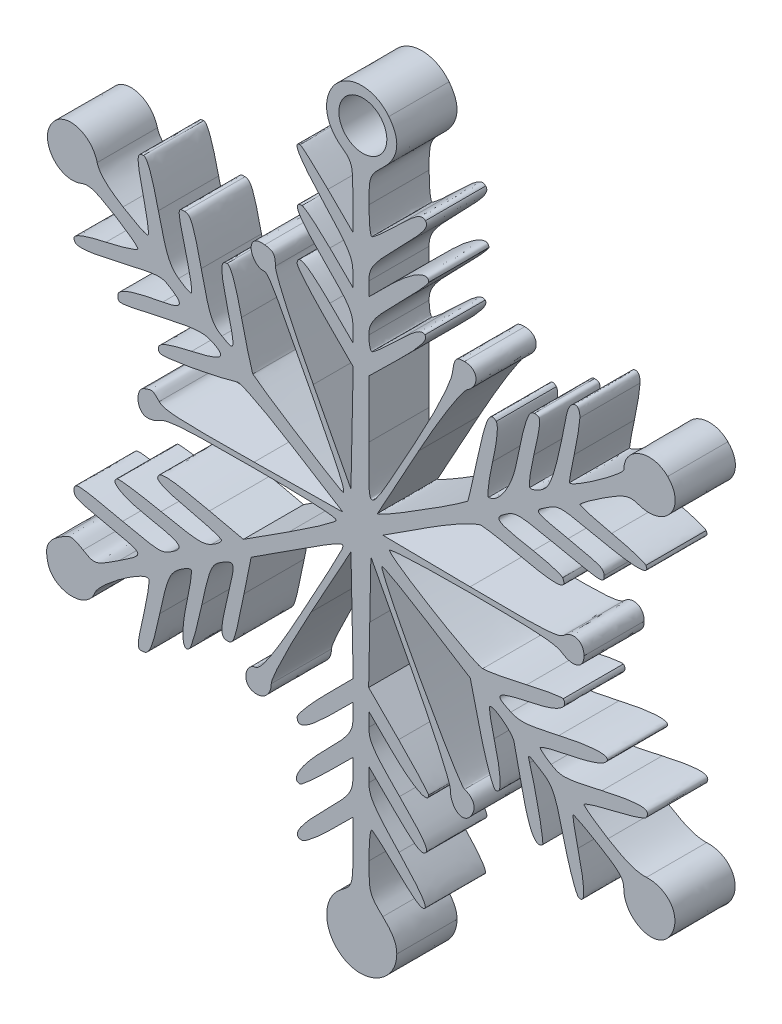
from build123d import *

# Parameters (mm, degrees)
BOSS_EXTRUDE1_DEPTH = 4
SKETCH3_R           = 1.592218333
CUT_EXTRUDE1_DEPTH  = 4


with BuildPart() as part:
    # Model → Boss-Extrude1 (new body)
    with BuildSketch(Plane.XY):
        with BuildLine():
            Line((27.5578062, 9.3178884), (27.5578062, 11.310366))
            Line((27.5578062, 11.310366), (26.028777, 9.797288))
            add(Edge.make_bspline(
                [(26.028777, 9.797288), (25.1878084, 8.9651078), (24.3543582, 8.2842354), (24.1766852, 8.2842354)],
                knots=[0, 0, 0, 0, 1, 1, 1, 1], degree=3))
            add(Edge.make_bspline(
                [(24.1766852, 8.2842354), (23.4748832, 8.2842354), (23.935055, 9.0406728), (25.7057144, 10.7977686)],
                knots=[0, 0, 0, 0, 1, 1, 1, 1], degree=3))
            add(Edge.make_bspline(
                [(25.7057144, 10.7977686), (27.3834606, 12.462637), (27.5578062, 12.7352298), (27.5578062, 13.6934448)],
                knots=[0, 0, 0, 0, 1, 1, 1, 1], degree=3))
            Line((27.5578062, 13.6934448), (27.5578062, 14.7512278))
            Line((27.5578062, 14.7512278), (25.8970272, 13.1052316))
            add(Edge.make_bspline(
                [(25.8970272, 13.1052316), (24.9836178, 12.1999248), (24.1501676, 11.4592354), (24.0449354, 11.4592354)],
                knots=[0, 0, 0, 0, 1, 1, 1, 1], degree=3))
            add(Edge.make_bspline(
                [(24.0449354, 11.4592354), (23.3943652, 11.4592354), (24.1063526, 12.6502668), (25.7057144, 14.237335)],
                knots=[0, 0, 0, 0, 1, 1, 1, 1], degree=3))
            add(Edge.make_bspline(
                [(25.7057144, 14.237335), (27.2950178, 15.8144718), (27.5578062, 16.2064446), (27.5578062, 17.000093)],
                knots=[0, 0, 0, 0, 1, 1, 1, 1], degree=3))
            Line((27.5578062, 17.000093), (27.5578062, 17.9249324))
            Line((27.5578062, 17.9249324), (26.028777, 16.4118798))
            add(Edge.make_bspline(
                [(26.028777, 16.4118798), (24.539448, 14.9380956), (23.8536226, 14.563344), (23.8536226, 15.2233122)],
                knots=[0, 0, 0, 0, 1, 1, 1, 1], degree=3))
            add(Edge.make_bspline(
                [(23.8536226, 15.2233122), (23.8536226, 15.401798), (24.690578, 16.3903914), (25.7135122, 17.420209)],
                knots=[0, 0, 0, 0, 1, 1, 1, 1], degree=3))
            Line((25.7135122, 17.420209), (27.5734018, 19.2925954))
            Line((27.5734018, 19.2925954), (27.4994116, 22.8981508))
            Line((27.4994116, 22.8981508), (27.4254976, 26.5037062))
            Line((27.4254976, 26.5037062), (24.7796812, 21.7193368))
            add(Edge.make_bspline(
                [(24.7796812, 21.7193368), (23.3244644, 19.0879476), (22.1338394, 16.6392352), (22.1338394, 16.2777932)],
                knots=[0, 0, 0, 0, 1, 1, 1, 1], degree=3))
            add(Edge.make_bspline(
                [(22.1338394, 16.2777932), (22.1338394, 15.5156916), (21.480145, 15.002256), (20.8283302, 15.2523952)],
                knots=[0, 0, 0, 0, 1, 1, 1, 1], degree=3))
            add(Edge.make_bspline(
                [(20.8283302, 15.2523952), (20.2015852, 15.4928824), (20.3905104, 16.5959536), (21.0754976, 16.6954454)],
                knots=[0, 0, 0, 0, 1, 1, 1, 1], degree=3))
            add(Edge.make_bspline(
                [(21.0754976, 16.6954454), (21.4573866, 16.7509444), (22.3042734, 18.0354732), (24.1182144, 21.3106762)],
                knots=[0, 0, 0, 0, 1, 1, 1, 1], degree=3))
            add(Edge.make_bspline(
                [(24.1182144, 21.3106762), (25.5006602, 23.8067596), (26.7207492, 26.0736334), (26.8294866, 26.348182)],
                knots=[0, 0, 0, 0, 1, 1, 1, 1], degree=3))
            add(Edge.make_bspline(
                [(26.8294866, 26.348182), (27.0545814, 26.9164054), (26.8564868, 26.8104366), (22.9202488, 24.2573048)],
                knots=[0, 0, 0, 0, 1, 1, 1, 1], degree=3))
            Line((22.9202488, 24.2573048), (20.7962246, 22.8796088))
            Line((20.7962246, 22.8796088), (20.3236068, 20.5428596))
            add(Edge.make_bspline(
                [(20.3236068, 20.5428596), (19.6918834, 17.419447), (19.6441314, 17.2800518), (19.205575, 17.2800518)],
                knots=[0, 0, 0, 0, 1, 1, 1, 1], degree=3))
            add(Edge.make_bspline(
                [(19.205575, 17.2800518), (18.7356496, 17.2800518), (18.7401708, 17.7703226), (19.228689, 19.793585)],
                knots=[0, 0, 0, 0, 1, 1, 1, 1], degree=3))
            add(Edge.make_bspline(
                [(19.228689, 19.793585), (19.7778116, 22.0677994), (19.75993, 22.1549722), (18.8542168, 21.6199466)],
                knots=[0, 0, 0, 0, 1, 1, 1, 1], degree=3))
            add(Edge.make_bspline(
                [(18.8542168, 21.6199466), (18.1696614, 21.2155786), (18.0277262, 20.8834736), (17.5197262, 18.4977786)],
                knots=[0, 0, 0, 0, 1, 1, 1, 1], degree=3))
            add(Edge.make_bspline(
                [(17.5197262, 18.4977786), (17.2070776, 17.0294554), (16.8413176, 15.7181804), (16.7069262, 15.5838144)],
                knots=[0, 0, 0, 0, 1, 1, 1, 1], degree=3))
            add(Edge.make_bspline(
                [(16.7069262, 15.5838144), (16.2053524, 15.0822152), (16.1181796, 16.3070286), (16.5238684, 18.1558692)],
                knots=[0, 0, 0, 0, 1, 1, 1, 1], degree=3))
            add(Edge.make_bspline(
                [(16.5238684, 18.1558692), (16.7523668, 19.197193), (16.8857422, 20.1027792), (16.820261, 20.1682604)],
                knots=[0, 0, 0, 0, 1, 1, 1, 1], degree=3))
            add(Edge.make_bspline(
                [(16.820261, 20.1682604), (16.7547544, 20.233767), (16.3815268, 20.0486772), (15.9908494, 19.7569836)],
                knots=[0, 0, 0, 0, 1, 1, 1, 1], degree=3))
            add(Edge.make_bspline(
                [(15.9908494, 19.7569836), (15.3958798, 19.312763), (15.1908002, 18.8002164), (14.7282662, 16.6013638)],
                knots=[0, 0, 0, 0, 1, 1, 1, 1], degree=3))
            add(Edge.make_bspline(
                [(14.7282662, 16.6013638), (14.3093948, 14.6101054), (14.066647, 13.9550394), (13.7231374, 13.8888724)],
                knots=[0, 0, 0, 0, 1, 1, 1, 1], degree=3))
            add(Edge.make_bspline(
                [(13.7231374, 13.8888724), (13.1676394, 13.781913), (13.1669282, 13.847191), (13.6986518, 16.2018218)],
                knots=[0, 0, 0, 0, 1, 1, 1, 1], degree=3))
            add(Edge.make_bspline(
                [(13.6986518, 16.2018218), (13.9342876, 17.2452284), (14.0653008, 18.1606698), (13.989812, 18.2361586)],
                knots=[0, 0, 0, 0, 1, 1, 1, 1], degree=3))
            add(Edge.make_bspline(
                [(13.989812, 18.2361586), (13.6853676, 18.540603), (10.7029504, 16.387064), (10.4309164, 15.6663644)],
                knots=[0, 0, 0, 0, 1, 1, 1, 1], degree=3))
            add(Edge.make_bspline(
                [(10.4309164, 15.6663644), (9.9079812, 14.2809722), (7.6540868, 14.3880078), (7.2958706, 15.8152592)],
                knots=[0, 0, 0, 0, 1, 1, 1, 1], degree=3))
            add(Edge.make_bspline(
                [(7.2958706, 15.8152592), (7.0738746, 16.6996872), (7.2725788, 17.151985), (8.1296256, 17.7135536)],
                knots=[0, 0, 0, 0, 1, 1, 1, 1], degree=3))
            add(Edge.make_bspline(
                [(8.1296256, 17.7135536), (8.8025732, 18.1544976), (8.8785446, 18.1548024), (9.6368362, 17.719548)],
                knots=[0, 0, 0, 0, 1, 1, 1, 1], degree=3))
            add(Edge.make_bspline(
                [(9.6368362, 17.719548), (10.4337612, 17.2621702), (10.4386634, 17.2633894), (12.0404382, 18.3160162)],
                knots=[0, 0, 0, 0, 1, 1, 1, 1], degree=3))
            add(Edge.make_bspline(
                [(12.0404382, 18.3160162), (13.7654538, 19.4496436), (13.7732516, 19.4294506), (11.4181382, 19.9283574)],
                knots=[0, 0, 0, 0, 1, 1, 1, 1], degree=3))
            add(Edge.make_bspline(
                [(11.4181382, 19.9283574), (9.1966542, 20.3989686), (9.0368882, 20.462113), (9.0368882, 20.8697068)],
                knots=[0, 0, 0, 0, 1, 1, 1, 1], degree=3))
            add(Edge.make_bspline(
                [(9.0368882, 20.8697068), (9.0368882, 21.3661498), (9.2373704, 21.354415), (12.2628914, 20.6807562)],
                knots=[0, 0, 0, 0, 1, 1, 1, 1], degree=3))
            add(Edge.make_bspline(
                [(12.2628914, 20.6807562), (14.7275296, 20.1319638), (14.8551646, 20.1278744), (15.5389326, 20.575905)],
                knots=[0, 0, 0, 0, 1, 1, 1, 1], degree=3))
            add(Edge.make_bspline(
                [(15.5389326, 20.575905), (16.4282628, 21.1586318), (16.1567622, 21.3580726), (13.8927078, 21.7852752)],
                knots=[0, 0, 0, 0, 1, 1, 1, 1], degree=3))
            add(Edge.make_bspline(
                [(13.8927078, 21.7852752), (12.309094, 22.0840808), (11.3806986, 22.6183698), (11.8939056, 22.9355396)],
                knots=[0, 0, 0, 0, 1, 1, 1, 1], degree=3))
            add(Edge.make_bspline(
                [(11.8939056, 22.9355396), (12.0241568, 23.0160576), (13.3388354, 22.8275134), (14.8153374, 22.5165412)],
                knots=[0, 0, 0, 0, 1, 1, 1, 1], degree=3))
            add(Edge.make_bspline(
                [(14.8153374, 22.5165412), (17.1259754, 22.0299026), (17.5923448, 22.0006164), (18.1632098, 22.3061276)],
                knots=[0, 0, 0, 0, 1, 1, 1, 1], degree=3))
            add(Edge.make_bspline(
                [(18.1632098, 22.3061276), (18.5280046, 22.5013774), (18.82648, 22.7542344), (18.82648, 22.8680518)],
                knots=[0, 0, 0, 0, 1, 1, 1, 1], degree=3))
            add(Edge.make_bspline(
                [(18.82648, 22.8680518), (18.82648, 22.9818946), (17.87398, 23.2797096), (16.7098218, 23.5298742)],
                knots=[0, 0, 0, 0, 1, 1, 1, 1], degree=3))
            add(Edge.make_bspline(
                [(16.7098218, 23.5298742), (15.3532586, 23.8213646), (14.5931382, 24.1110516), (14.5931382, 24.3365274)],
                knots=[0, 0, 0, 0, 1, 1, 1, 1], degree=3))
            add(Edge.make_bspline(
                [(14.5931382, 24.3365274), (14.5931382, 24.8096024), (15.3597102, 24.771096), (18.03273, 24.163782)],
                knots=[0, 0, 0, 0, 1, 1, 1, 1], degree=3))
            Line((18.03273, 24.163782), (20.2816968, 23.6528102))
            Line((20.2816968, 23.6528102), (23.3169206, 25.6033524))
            add(Edge.make_bspline(
                [(23.3169206, 25.6033524), (24.9863102, 26.6761468), (26.3933178, 27.6774148), (26.4436352, 27.8283924)],
                knots=[0, 0, 0, 0, 1, 1, 1, 1], degree=3))
            add(Edge.make_bspline(
                [(26.4436352, 27.8283924), (26.5049508, 28.012136), (24.6848884, 28.103703), (20.9364834, 28.1054302)],
                knots=[0, 0, 0, 0, 1, 1, 1, 1], degree=3))
            add(Edge.make_bspline(
                [(20.9364834, 28.1054302), (16.4274246, 28.1074368), (15.2211532, 28.0315162), (14.7381976, 27.715083)],
                knots=[0, 0, 0, 0, 1, 1, 1, 1], degree=3))
            add(Edge.make_bspline(
                [(14.7381976, 27.715083), (14.4083786, 27.4989798), (13.9431776, 27.3971512), (13.7043922, 27.488769)],
                knots=[0, 0, 0, 0, 1, 1, 1, 1], degree=3))
            add(Edge.make_bspline(
                [(13.7043922, 27.488769), (13.1496562, 27.7016464), (13.1383278, 28.8144458), (13.6887966, 29.0256722)],
                knots=[0, 0, 0, 0, 1, 1, 1, 1], degree=3))
            add(Edge.make_bspline(
                [(13.6887966, 29.0256722), (14.2478506, 29.2402006), (14.233398, 29.2436804), (14.6927824, 28.784296)],
                knots=[0, 0, 0, 0, 1, 1, 1, 1], degree=3))
            add(Edge.make_bspline(
                [(14.6927824, 28.784296), (15.0328122, 28.4442662), (16.003905, 28.3932884), (20.9953352, 28.4535626)],
                knots=[0, 0, 0, 0, 1, 1, 1, 1], degree=3))
            Line((20.9953352, 28.4535626), (26.8959076, 28.5247588))
            Line((26.8959076, 28.5247588), (23.605871, 30.577536))
            add(Edge.make_bspline(
                [(23.605871, 30.577536), (21.7963496, 31.706566), (20.1295762, 32.5740014), (19.901916, 32.5051928)],
                knots=[0, 0, 0, 0, 1, 1, 1, 1], degree=3))
            add(Edge.make_bspline(
                [(19.901916, 32.5051928), (18.2168546, 31.9959228), (14.8274532, 31.4024772), (14.707997, 31.5957966)],
                knots=[0, 0, 0, 0, 1, 1, 1, 1], degree=3))
            add(Edge.make_bspline(
                [(14.707997, 31.5957966), (14.4198086, 32.0620898), (14.8865844, 32.314515), (16.841216, 32.7493884)],
                knots=[0, 0, 0, 0, 1, 1, 1, 1], degree=3))
            add(Edge.make_bspline(
                [(16.841216, 32.7493884), (18.9400942, 33.216342), (19.2454022, 33.504632), (18.1631844, 33.9977222)],
                knots=[0, 0, 0, 0, 1, 1, 1, 1], degree=3))
            add(Edge.make_bspline(
                [(18.1631844, 33.9977222), (17.6331372, 34.2392254), (16.9819574, 34.1846154), (14.9220682, 33.7259676)],
                knots=[0, 0, 0, 0, 1, 1, 1, 1], degree=3))
            add(Edge.make_bspline(
                [(14.9220682, 33.7259676), (11.8690644, 33.0461874), (11.9473472, 33.0510134), (11.9473472, 33.5416652)],
                knots=[0, 0, 0, 0, 1, 1, 1, 1], degree=3))
            add(Edge.make_bspline(
                [(11.9473472, 33.5416652), (11.9473472, 33.9215476), (12.8616456, 34.2537034), (14.9268434, 34.6240354)],
                knots=[0, 0, 0, 0, 1, 1, 1, 1], degree=3))
            add(Edge.make_bspline(
                [(14.9268434, 34.6240354), (16.2021774, 34.8527116), (16.3414456, 35.1054416), (15.4970734, 35.6587044)],
                knots=[0, 0, 0, 0, 1, 1, 1, 1], degree=3))
            add(Edge.make_bspline(
                [(15.4970734, 35.6587044), (14.8563076, 36.078541), (14.6837146, 36.0727244), (12.4366528, 35.5553518)],
                knots=[0, 0, 0, 0, 1, 1, 1, 1], degree=3))
            add(Edge.make_bspline(
                [(12.4366528, 35.5553518), (9.6458024, 34.9127826), (9.036939, 34.8787974), (9.036939, 35.3656646)],
                knots=[0, 0, 0, 0, 1, 1, 1, 1], degree=3))
            add(Edge.make_bspline(
                [(9.036939, 35.3656646), (9.036939, 35.5994208), (9.7738692, 35.8834944), (11.1535972, 36.1815888)],
                knots=[0, 0, 0, 0, 1, 1, 1, 1], degree=3))
            add(Edge.make_bspline(
                [(11.1535972, 36.1815888), (12.3177554, 36.433125), (13.2702554, 36.7393728), (13.2702554, 36.8621564)],
                knots=[0, 0, 0, 0, 1, 1, 1, 1], degree=3))
            add(Edge.make_bspline(
                [(13.2702554, 36.8621564), (13.2702554, 36.9849654), (12.5676152, 37.512244), (11.7087904, 38.03396)],
                knots=[0, 0, 0, 0, 1, 1, 1, 1], degree=3))
            add(Edge.make_bspline(
                [(11.7087904, 38.03396), (10.4299004, 38.8108444), (10.0301552, 38.937946), (9.4999048, 38.7363462)],
                knots=[0, 0, 0, 0, 1, 1, 1, 1], degree=3))
            add(Edge.make_bspline(
                [(9.4999048, 38.7363462), (8.025892, 38.175946), (6.6758566, 39.8793462), (7.5439778, 41.204261)],
                knots=[0, 0, 0, 0, 1, 1, 1, 1], degree=3))
            add(Edge.make_bspline(
                [(7.5439778, 41.204261), (8.3464908, 42.4290744), (10.1660706, 41.9881812), (10.5719372, 40.4706074)],
                knots=[0, 0, 0, 0, 1, 1, 1, 1], degree=3))
            add(Edge.make_bspline(
                [(10.5719372, 40.4706074), (10.713339, 39.9419064), (11.2258094, 39.4362178), (12.2893328, 38.7760464)],
                knots=[0, 0, 0, 0, 1, 1, 1, 1], degree=3))
            add(Edge.make_bspline(
                [(12.2893328, 38.7760464), (13.123037, 38.258496), (13.869289, 37.8991114), (13.9475972, 37.977445)],
                knots=[0, 0, 0, 0, 1, 1, 1, 1], degree=3))
            add(Edge.make_bspline(
                [(13.9475972, 37.977445), (14.0259054, 38.0557278), (13.9055856, 38.9151368), (13.6801352, 39.8871694)],
                knots=[0, 0, 0, 0, 1, 1, 1, 1], degree=3))
            add(Edge.make_bspline(
                [(13.6801352, 39.8871694), (13.1751324, 42.0647622), (13.170027, 42.4153838), (13.6434322, 42.4153838)],
                knots=[0, 0, 0, 0, 1, 1, 1, 1], degree=3))
            add(Edge.make_bspline(
                [(13.6434322, 42.4153838), (13.8993372, 42.4153838), (14.211046, 41.5722308), (14.6356324, 39.7314674)],
                knots=[0, 0, 0, 0, 1, 1, 1, 1], degree=3))
            add(Edge.make_bspline(
                [(14.6356324, 39.7314674), (15.150846, 37.4977406), (15.376017, 36.9570254), (15.9779462, 36.5080296)],
                knots=[0, 0, 0, 0, 1, 1, 1, 1], degree=3))
            add(Edge.make_bspline(
                [(15.9779462, 36.5080296), (16.375761, 36.2113068), (16.7578532, 36.0251756), (16.8270682, 36.0943652)],
                knots=[0, 0, 0, 0, 1, 1, 1, 1], degree=3))
            add(Edge.make_bspline(
                [(16.8270682, 36.0943652), (16.8962578, 36.1635802), (16.7913558, 36.8699796), (16.5940232, 37.6641614)],
                knots=[0, 0, 0, 0, 1, 1, 1, 1], degree=3))
            add(Edge.make_bspline(
                [(16.5940232, 37.6641614), (15.8631382, 40.6047448), (15.8660592, 40.5633174), (16.3903152, 40.5633174)],
                knots=[0, 0, 0, 0, 1, 1, 1, 1], degree=3))
            add(Edge.make_bspline(
                [(16.3903152, 40.5633174), (16.7892476, 40.5633174), (16.9816526, 40.0808952), (17.4822866, 37.8253244)],
                knots=[0, 0, 0, 0, 1, 1, 1, 1], degree=3))
            add(Edge.make_bspline(
                [(17.4822866, 37.8253244), (18.0238908, 35.3852988), (18.1732936, 35.038157), (18.8551566, 34.6353638)],
                knots=[0, 0, 0, 0, 1, 1, 1, 1], degree=3))
            add(Edge.make_bspline(
                [(18.8551566, 34.6353638), (19.7555612, 34.1034878), (19.7700646, 34.176462), (19.218148, 36.4622588)],
                knots=[0, 0, 0, 0, 1, 1, 1, 1], degree=3))
            add(Edge.make_bspline(
                [(19.218148, 36.4622588), (18.7362084, 38.4582162), (18.731357, 38.9758174), (19.1945514, 38.9758174)],
                knots=[0, 0, 0, 0, 1, 1, 1, 1], degree=3))
            add(Edge.make_bspline(
                [(19.1945514, 38.9758174), (19.444081, 38.9758174), (19.7540372, 38.1312928), (20.1574146, 36.3521498)],
                knots=[0, 0, 0, 0, 1, 1, 1, 1], degree=3))
            add(Edge.make_bspline(
                [(20.1574146, 36.3521498), (20.484592, 34.909125), (20.8250028, 33.6176874), (20.9138774, 33.4822546)],
                knots=[0, 0, 0, 0, 1, 1, 1, 1], degree=3))
            add(Edge.make_bspline(
                [(20.9138774, 33.4822546), (21.0660488, 33.2504542), (25.5548892, 30.362525), (26.7928598, 29.699966)],
                knots=[0, 0, 0, 0, 1, 1, 1, 1], degree=3))
            add(Edge.make_bspline(
                [(26.7928598, 29.699966), (27.2269966, 29.4676322), (26.7754608, 30.5238404), (24.9035824, 34.1190834)],
                knots=[0, 0, 0, 0, 1, 1, 1, 1], degree=3))
            add(Edge.make_bspline(
                [(24.9035824, 34.1190834), (21.985097, 39.724584), (21.9585794, 39.7695674), (21.5734392, 39.7695674)],
                knots=[0, 0, 0, 0, 1, 1, 1, 1], degree=3))
            add(Edge.make_bspline(
                [(21.5734392, 39.7695674), (21.0873594, 39.7695674), (20.6554324, 40.4595584), (20.8401412, 40.9409646)],
                knots=[0, 0, 0, 0, 1, 1, 1, 1], degree=3))
            add(Edge.make_bspline(
                [(20.8401412, 40.9409646), (20.9529172, 41.2348426), (21.2461348, 41.3583882), (21.7046048, 41.305226)],
                knots=[0, 0, 0, 0, 1, 1, 1, 1], degree=3))
            add(Edge.make_bspline(
                [(21.7046048, 41.305226), (22.2783146, 41.2387288), (22.4002854, 41.0873448), (22.40915, 40.4310088)],
                knots=[0, 0, 0, 0, 1, 1, 1, 1], degree=3))
            add(Edge.make_bspline(
                [(22.40915, 40.4310088), (22.4151444, 39.9561558), (23.425404, 37.7254516), (24.9227086, 34.8785688)],
                knots=[0, 0, 0, 0, 1, 1, 1, 1], degree=3))
            Line((24.9227086, 34.8785688), (27.4254976, 30.1198534))
            Line((27.4254976, 30.1198534), (27.4997164, 33.6736182))
            Line((27.4997164, 33.6736182), (27.5739098, 37.227383))
            Line((27.5739098, 37.227383), (25.7137916, 39.099998))
            add(Edge.make_bspline(
                [(25.7137916, 39.099998), (24.690705, 40.1299426), (23.853648, 41.118663), (23.853648, 41.2971234)],
                knots=[0, 0, 0, 0, 1, 1, 1, 1], degree=3))
            add(Edge.make_bspline(
                [(23.853648, 41.2971234), (23.853648, 41.957117), (24.5394988, 41.58234), (26.0288024, 40.1085558)],
                knots=[0, 0, 0, 0, 1, 1, 1, 1], degree=3))
            Line((26.0288024, 40.1085558), (27.5578316, 38.5955032))
            Line((27.5578316, 38.5955032), (27.5578316, 39.5203426))
            add(Edge.make_bspline(
                [(27.5578316, 39.5203426), (27.5578316, 40.313991), (27.2950432, 40.7059638), (25.7057398, 42.2831006)],
                knots=[0, 0, 0, 0, 1, 1, 1, 1], degree=3))
            add(Edge.make_bspline(
                [(25.7057398, 42.2831006), (23.9350804, 44.0401964), (23.4749086, 44.7966338), (24.1767106, 44.7966338)],
                knots=[0, 0, 0, 0, 1, 1, 1, 1], degree=3))
            add(Edge.make_bspline(
                [(24.1767106, 44.7966338), (24.354409, 44.7966338), (25.1878338, 44.1157614), (26.0288024, 43.2835558)],
                knots=[0, 0, 0, 0, 1, 1, 1, 1], degree=3))
            Line((26.0288024, 43.2835558), (27.5578316, 41.7705032))
            Line((27.5578316, 41.7705032), (27.5538184, 42.688256))
            add(Edge.make_bspline(
                [(27.5538184, 42.688256), (27.5508212, 43.455463), (27.247342, 43.9315352), (25.7057144, 45.5903838)],
                knots=[0, 0, 0, 0, 1, 1, 1, 1], degree=3))
            add(Edge.make_bspline(
                [(25.7057144, 45.5903838), (24.0431828, 47.3793312), (23.5053124, 48.2362256), (24.0449354, 48.2362256)],
                knots=[0, 0, 0, 0, 1, 1, 1, 1], degree=3))
            add(Edge.make_bspline(
                [(24.0449354, 48.2362256), (24.1501676, 48.2362256), (24.9836178, 47.4955362), (25.8970272, 46.5902294)],
                knots=[0, 0, 0, 0, 1, 1, 1, 1], degree=3))
            Line((25.8970272, 46.5902294), (27.5577808, 44.9442078))
            Line((27.5577808, 44.9442078), (27.5577808, 46.9373458))
            add(Edge.make_bspline(
                [(27.5577808, 46.9373458), (27.5577808, 48.8319064), (27.5196808, 48.9586524), (26.7870686, 49.500282)],
                knots=[0, 0, 0, 0, 1, 1, 1, 1], degree=3))
            add(Edge.make_bspline(
                [(26.7870686, 49.500282), (25.8190238, 50.2159778), (25.535509, 51.3729732), (26.0733286, 52.4129762)],
                knots=[0, 0, 0, 0, 1, 1, 1, 1], degree=3))
            add(Edge.make_bspline(
                [(26.0733286, 52.4129762), (26.8561566, 53.9268162), (28.8967164, 54.1314386), (29.9432218, 52.801012)],
                knots=[0, 0, 0, 0, 1, 1, 1, 1], degree=3))
            add(Edge.make_bspline(
                [(29.9432218, 52.801012), (30.7603906, 51.762152), (30.623383, 50.6940312), (29.5421812, 49.6742974)],
                knots=[0, 0, 0, 0, 1, 1, 1, 1], degree=3))
            add(Edge.make_bspline(
                [(29.5421812, 49.6742974), (28.6664908, 48.8484418), (28.6161226, 48.706405), (28.6161226, 47.0633552)],
                knots=[0, 0, 0, 0, 1, 1, 1, 1], degree=3))
            add(Edge.make_bspline(
                [(28.6161226, 47.0633552), (28.6161226, 46.1077056), (28.7020254, 45.3258174), (28.806902, 45.3258174)],
                knots=[0, 0, 0, 0, 1, 1, 1, 1], degree=3))
            add(Edge.make_bspline(
                [(28.806902, 45.3258174), (28.911804, 45.3258174), (29.684599, 46.0055976), (30.524196, 46.8364062)],
                knots=[0, 0, 0, 0, 1, 1, 1, 1], degree=3))
            add(Edge.make_bspline(
                [(30.524196, 46.8364062), (31.7272416, 48.0269296), (32.1192906, 48.2784658), (32.3742304, 48.023526)],
                knots=[0, 0, 0, 0, 1, 1, 1, 1], degree=3))
            add(Edge.make_bspline(
                [(32.3742304, 48.023526), (32.6291956, 47.7685608), (32.2652898, 47.2650058), (30.6569364, 45.6471528)],
                knots=[0, 0, 0, 0, 1, 1, 1, 1], degree=3))
            add(Edge.make_bspline(
                [(30.6569364, 45.6471528), (28.9040824, 43.883961), (28.6161226, 43.4656484), (28.6161226, 42.682414)],
                knots=[0, 0, 0, 0, 1, 1, 1, 1], degree=3))
            Line((28.6161226, 42.682414), (28.6161226, 41.7705032))
            Line((28.6161226, 41.7705032), (30.1451518, 43.2835558))
            add(Edge.make_bspline(
                [(30.1451518, 43.2835558), (31.492063, 44.6164208), (32.5848726, 45.2023226), (32.5848726, 44.5915796)],
                knots=[0, 0, 0, 0, 1, 1, 1, 1], degree=3))
            add(Edge.make_bspline(
                [(32.5848726, 44.5915796), (32.5848726, 44.4788036), (31.6919102, 43.4995066), (30.6004976, 42.4153838)],
                knots=[0, 0, 0, 0, 1, 1, 1, 1], degree=3))
            add(Edge.make_bspline(
                [(30.6004976, 42.4153838), (28.9362388, 40.7622248), (28.6161226, 40.304466), (28.6161226, 39.5777466)],
                knots=[0, 0, 0, 0, 1, 1, 1, 1], degree=3))
            add(Edge.make_bspline(
                [(28.6161226, 39.5777466), (28.6161226, 39.1011664), (28.7020254, 38.7112256), (28.806902, 38.7112256)],
                knots=[0, 0, 0, 0, 1, 1, 1, 1], degree=3))
            add(Edge.make_bspline(
                [(28.806902, 38.7112256), (28.911804, 38.7112256), (29.684599, 39.3910058), (30.524196, 40.2218398)],
                knots=[0, 0, 0, 0, 1, 1, 1, 1], degree=3))
            add(Edge.make_bspline(
                [(30.524196, 40.2218398), (31.6262512, 41.3124142), (32.1309492, 41.6522154), (32.3392292, 41.4439354)],
                knots=[0, 0, 0, 0, 1, 1, 1, 1], degree=3))
            add(Edge.make_bspline(
                [(32.3392292, 41.4439354), (32.5475092, 41.2356554), (32.0699892, 40.6084532), (30.6219352, 39.1882884)],
                knots=[0, 0, 0, 0, 1, 1, 1, 1], degree=3))
            Line((30.6219352, 39.1882884), (28.6161226, 37.2211346))
            Line((28.6161226, 37.2211346), (28.6161226, 33.4094074))
            add(Edge.make_bspline(
                [(28.6161226, 33.4094074), (28.6161226, 28.9729926), (28.3097224, 28.8257488), (31.6651386, 34.8747588)],
                knots=[0, 0, 0, 0, 1, 1, 1, 1], degree=3))
            add(Edge.make_bspline(
                [(31.6651386, 34.8747588), (33.070419, 37.4081548), (34.0718648, 39.5330934), (34.1590376, 40.1664424)],
                knots=[0, 0, 0, 0, 1, 1, 1, 1], degree=3))
            add(Edge.make_bspline(
                [(34.1590376, 40.1664424), (34.2847676, 41.0801058), (34.3950798, 41.2247588), (34.9661226, 41.2247588)],
                knots=[0, 0, 0, 0, 1, 1, 1, 1], degree=3))
            add(Edge.make_bspline(
                [(34.9661226, 41.2247588), (35.887025, 41.2247588), (36.0050588, 40.2556472), (35.152203, 39.6968472)],
                knots=[0, 0, 0, 0, 1, 1, 1, 1], degree=3))
            add(Edge.make_bspline(
                [(35.152203, 39.6968472), (34.7954346, 39.463091), (33.3830676, 37.2178834), (31.923609, 34.5644724)],
                knots=[0, 0, 0, 0, 1, 1, 1, 1], degree=3))
            add(Edge.make_bspline(
                [(31.923609, 34.5644724), (30.4966624, 31.9702434), (29.2667436, 29.735653), (29.1903912, 29.5987216)],
                knots=[0, 0, 0, 0, 1, 1, 1, 1], degree=3))
            add(Edge.make_bspline(
                [(29.1903912, 29.5987216), (29.0206938, 29.2943026), (33.7059016, 32.1854068), (35.170364, 33.2887574)],
                knots=[0, 0, 0, 0, 1, 1, 1, 1], degree=3))
            add(Edge.make_bspline(
                [(35.170364, 33.2887574), (35.2099626, 33.3185516), (35.491801, 34.5210638), (35.7967534, 35.960939)],
                knots=[0, 0, 0, 0, 1, 1, 1, 1], degree=3))
            add(Edge.make_bspline(
                [(35.7967534, 35.960939), (36.3720126, 38.6773928), (36.6333786, 39.2667998), (37.0691156, 38.8302754)],
                knots=[0, 0, 0, 0, 1, 1, 1, 1], degree=3))
            add(Edge.make_bspline(
                [(37.0691156, 38.8302754), (37.2272814, 38.6718302), (37.1401086, 37.772213), (36.8332004, 36.3961172)],
                knots=[0, 0, 0, 0, 1, 1, 1, 1], degree=3))
            add(Edge.make_bspline(
                [(36.8332004, 36.3961172), (36.5654336, 35.1955862), (36.4459012, 34.2133174), (36.5675418, 34.2133174)],
                knots=[0, 0, 0, 0, 1, 1, 1, 1], degree=3))
            add(Edge.make_bspline(
                [(36.5675418, 34.2133174), (37.2369842, 34.2133174), (38.0958344, 35.521011), (38.3921, 36.9914424)],
                knots=[0, 0, 0, 0, 1, 1, 1, 1], degree=3))
            add(Edge.make_bspline(
                [(38.3921, 36.9914424), (38.9701532, 39.8603978), (39.2091418, 40.5633174), (39.6065248, 40.5633174)],
                knots=[0, 0, 0, 0, 1, 1, 1, 1], degree=3))
            add(Edge.make_bspline(
                [(39.6065248, 40.5633174), (40.0905726, 40.5633174), (40.0885152, 40.42537), (39.5708378, 38.1495046)],
                knots=[0, 0, 0, 0, 1, 1, 1, 1], degree=3))
            add(Edge.make_bspline(
                [(39.5708378, 38.1495046), (39.3385548, 37.1282468), (39.2157712, 36.2254038), (39.297991, 36.143184)],
                knots=[0, 0, 0, 0, 1, 1, 1, 1], degree=3))
            add(Edge.make_bspline(
                [(39.297991, 36.143184), (39.3801854, 36.0609896), (39.7355822, 36.1825032), (40.0877024, 36.413186)],
                knots=[0, 0, 0, 0, 1, 1, 1, 1], degree=3))
            add(Edge.make_bspline(
                [(40.0877024, 36.413186), (40.7053034, 36.8178588), (41.0045154, 37.7466352), (41.7443666, 41.5554922)],
                knots=[0, 0, 0, 0, 1, 1, 1, 1], degree=3))
            add(Edge.make_bspline(
                [(41.7443666, 41.5554922), (41.9330124, 42.5266612), (42.64406, 42.7391576), (42.629709, 41.820084)],
                knots=[0, 0, 0, 0, 1, 1, 1, 1], degree=3))
            add(Edge.make_bspline(
                [(42.629709, 41.820084), (42.6247052, 41.4926526), (42.4547792, 40.4519892), (42.2523412, 39.5075156)],
                knots=[0, 0, 0, 0, 1, 1, 1, 1], degree=3))
            add(Edge.make_bspline(
                [(42.2523412, 39.5075156), (42.0499032, 38.5630166), (41.9078664, 37.7666504), (41.9366954, 37.7378468)],
                knots=[0, 0, 0, 0, 1, 1, 1, 1], degree=3))
            add(Edge.make_bspline(
                [(41.9366954, 37.7378468), (42.1274748, 37.547042), (45.5494136, 39.976806), (45.5494136, 40.303069)],
                knots=[0, 0, 0, 0, 1, 1, 1, 1], degree=3))
            add(Edge.make_bspline(
                [(45.5494136, 40.303069), (45.5494136, 41.714166), (47.4238828, 42.3930064), (48.4598218, 41.3570674)],
                knots=[0, 0, 0, 0, 1, 1, 1, 1], degree=3))
            add(Edge.make_bspline(
                [(48.4598218, 41.3570674), (49.7515896, 40.0652996), (48.3283006, 38.1510794), (46.5397088, 38.7745732)],
                knots=[0, 0, 0, 0, 1, 1, 1, 1], degree=3))
            add(Edge.make_bspline(
                [(46.5397088, 38.7745732), (45.9090776, 38.9944356), (45.5879708, 38.888416), (44.2255402, 38.0106428)],
                knots=[0, 0, 0, 0, 1, 1, 1, 1], degree=3))
            add(Edge.make_bspline(
                [(44.2255402, 38.0106428), (43.3554886, 37.4500648), (42.6425868, 36.9224052), (42.6413168, 36.8380518)],
                knots=[0, 0, 0, 0, 1, 1, 1, 1], degree=3))
            add(Edge.make_bspline(
                [(42.6413168, 36.8380518), (42.6403008, 36.7536476), (43.587543, 36.4808516), (44.7468498, 36.231703)],
                knots=[0, 0, 0, 0, 1, 1, 1, 1], degree=3))
            add(Edge.make_bspline(
                [(44.7468498, 36.231703), (45.906182, 35.9826052), (46.9257634, 35.6638098), (47.0125806, 35.5233224)],
                knots=[0, 0, 0, 0, 1, 1, 1, 1], degree=3))
            add(Edge.make_bspline(
                [(47.0125806, 35.5233224), (47.343695, 34.9875856), (46.298739, 34.987865), (43.8233566, 35.524186)],
                knots=[0, 0, 0, 0, 1, 1, 1, 1], degree=3))
            add(Edge.make_bspline(
                [(43.8233566, 35.524186), (41.2642812, 36.0786172), (41.2550356, 36.0787188), (40.4330408, 35.5582728)],
                knots=[0, 0, 0, 0, 1, 1, 1, 1], degree=3))
            add(Edge.make_bspline(
                [(40.4330408, 35.5582728), (39.5159738, 34.9776288), (39.5318488, 34.9654622), (41.84523, 34.4753946)],
                knots=[0, 0, 0, 0, 1, 1, 1, 1], degree=3))
            add(Edge.make_bspline(
                [(41.84523, 34.4753946), (44.0667394, 34.0047834), (44.22648, 33.941639), (44.22648, 33.5340452)],
                knots=[0, 0, 0, 0, 1, 1, 1, 1], degree=3))
            add(Edge.make_bspline(
                [(44.22648, 33.5340452), (44.22648, 33.0490322), (44.2106812, 33.049972), (41.0683964, 33.7190588)],
                knots=[0, 0, 0, 0, 1, 1, 1, 1], degree=3))
            add(Edge.make_bspline(
                [(41.0683964, 33.7190588), (38.5270502, 34.2602058), (38.3904998, 34.2642444), (37.7102624, 33.818576)],
                knots=[0, 0, 0, 0, 1, 1, 1, 1], degree=3))
            add(Edge.make_bspline(
                [(37.7102624, 33.818576), (36.8298476, 33.2416912), (37.0742718, 33.0822808), (39.5334236, 32.6295258)],
                knots=[0, 0, 0, 0, 1, 1, 1, 1], degree=3))
            add(Edge.make_bspline(
                [(39.5334236, 32.6295258), (40.5174958, 32.4483476), (41.394126, 32.1844162), (41.481502, 32.0430398)],
                knots=[0, 0, 0, 0, 1, 1, 1, 1], degree=3))
            add(Edge.make_bspline(
                [(41.481502, 32.0430398), (41.8614606, 31.4282582), (41.0412184, 31.362523), (38.9348218, 31.8389762)],
                knots=[0, 0, 0, 0, 1, 1, 1, 1], degree=3))
            add(Edge.make_bspline(
                [(38.9348218, 31.8389762), (37.6978926, 32.1187572), (36.4161832, 32.3507354), (36.086542, 32.3544692)],
                knots=[0, 0, 0, 0, 1, 1, 1, 1], degree=3))
            add(Edge.make_bspline(
                [(36.086542, 32.3544692), (35.7569262, 32.358457), (34.1512398, 31.4980574), (32.5183754, 30.4430176)],
                knots=[0, 0, 0, 0, 1, 1, 1, 1], degree=3))
            Line((32.5183754, 30.4430176), (29.5495218, 28.5247842))
            Line((29.5495218, 28.5247842), (35.3400106, 28.4533848))
            add(Edge.make_bspline(
                [(35.3400106, 28.4533848), (40.2582126, 28.3927042), (41.1984698, 28.4434026), (41.5818828, 28.7904936)],
                knots=[0, 0, 0, 0, 1, 1, 1, 1], degree=3))
            add(Edge.make_bspline(
                [(41.5818828, 28.7904936), (42.1702738, 29.3229792), (42.9035718, 29.028771), (42.9035718, 28.2602178)],
                knots=[0, 0, 0, 0, 1, 1, 1, 1], degree=3))
            add(Edge.make_bspline(
                [(42.9035718, 28.2602178), (42.9035718, 27.4791932), (42.198036, 27.2155158), (41.4390078, 27.7128478)],
                knots=[0, 0, 0, 0, 1, 1, 1, 1], degree=3))
            add(Edge.make_bspline(
                [(41.4390078, 27.7128478), (40.961945, 28.0254202), (39.7490696, 28.1038046), (35.372421, 28.1049222)],
                knots=[0, 0, 0, 0, 1, 1, 1, 1], degree=3))
            add(Edge.make_bspline(
                [(35.372421, 28.1049222), (32.1949064, 28.1057096), (29.9375576, 28.0052272), (29.9866812, 27.865197)],
                knots=[0, 0, 0, 0, 1, 1, 1, 1], degree=3))
            add(Edge.make_bspline(
                [(29.9866812, 27.865197), (30.1514002, 27.3957796), (35.5512624, 24.1591846), (36.169727, 24.1591846)],
                knots=[0, 0, 0, 0, 1, 1, 1, 1], degree=3))
            add(Edge.make_bspline(
                [(36.169727, 24.1591846), (36.5150908, 24.1591846), (37.831268, 24.4001798), (39.0945624, 24.6947436)],
                knots=[0, 0, 0, 0, 1, 1, 1, 1], degree=3))
            add(Edge.make_bspline(
                [(39.0945624, 24.6947436), (40.3578568, 24.9893074), (41.448736, 25.1730256), (41.5187384, 25.1030232)],
                knots=[0, 0, 0, 0, 1, 1, 1, 1], degree=3))
            add(Edge.make_bspline(
                [(41.5187384, 25.1030232), (41.9051232, 24.7166384), (41.183941, 24.215598), (39.821485, 23.9238536)],
                knots=[0, 0, 0, 0, 1, 1, 1, 1], degree=3))
            add(Edge.make_bspline(
                [(39.821485, 23.9238536), (37.005006, 23.320756), (36.8022886, 23.1695244), (38.0488698, 22.601555)],
                knots=[0, 0, 0, 0, 1, 1, 1, 1], degree=3))
            add(Edge.make_bspline(
                [(38.0488698, 22.601555), (38.627685, 22.3378268), (39.184961, 22.3809052), (41.2346394, 22.8478334)],
                knots=[0, 0, 0, 0, 1, 1, 1, 1], degree=3))
            add(Edge.make_bspline(
                [(41.2346394, 22.8478334), (43.8156096, 23.4357926), (45.0612256, 23.3855514), (44.1704222, 22.7293932)],
                knots=[0, 0, 0, 0, 1, 1, 1, 1], degree=3))
            add(Edge.make_bspline(
                [(44.1704222, 22.7293932), (43.921299, 22.5459036), (42.8794926, 22.2376492), (41.8553138, 22.044406)],
                knots=[0, 0, 0, 0, 1, 1, 1, 1], degree=3))
            add(Edge.make_bspline(
                [(41.8553138, 22.044406), (40.8311096, 21.8511628), (39.9931636, 21.6187528), (39.9931636, 21.5279478)],
                knots=[0, 0, 0, 0, 1, 1, 1, 1], degree=3))
            add(Edge.make_bspline(
                [(39.9931636, 21.5279478), (39.9931636, 21.4371428), (40.3205696, 21.1699348), (40.720772, 20.9341466)],
                knots=[0, 0, 0, 0, 1, 1, 1, 1], degree=3))
            add(Edge.make_bspline(
                [(40.720772, 20.9341466), (41.4013904, 20.5331568), (41.6192208, 20.5443328), (44.0941968, 21.1072984)],
                knots=[0, 0, 0, 0, 1, 1, 1, 1], degree=3))
            add(Edge.make_bspline(
                [(44.0941968, 21.1072984), (46.5736432, 21.67128), (47.4162882, 21.6502742), (47.0354152, 21.033994)],
                knots=[0, 0, 0, 0, 1, 1, 1, 1], degree=3))
            add(Edge.make_bspline(
                [(47.0354152, 21.033994), (46.9467184, 20.8905348), (45.9807818, 20.5743556), (44.8888866, 20.3314554)],
                knots=[0, 0, 0, 0, 1, 1, 1, 1], degree=3))
            add(Edge.make_bspline(
                [(44.8888866, 20.3314554), (43.796966, 20.0885044), (42.9048926, 19.808571), (42.9064928, 19.7093586)],
                knots=[0, 0, 0, 0, 1, 1, 1, 1], degree=3))
            add(Edge.make_bspline(
                [(42.9064928, 19.7093586), (42.9084994, 19.6101716), (43.624754, 19.086195), (44.4990982, 18.5450226)],
                knots=[0, 0, 0, 0, 1, 1, 1, 1], degree=3))
            add(Edge.make_bspline(
                [(44.4990982, 18.5450226), (45.6413108, 17.8380644), (46.359572, 17.5712628), (47.050706, 17.597247)],
                knots=[0, 0, 0, 0, 1, 1, 1, 1], degree=3))
            add(Edge.make_bspline(
                [(47.050706, 17.597247), (48.6393744, 17.6569624), (49.466246, 16.227044), (48.577119, 14.9576282)],
                knots=[0, 0, 0, 0, 1, 1, 1, 1], degree=3))
            add(Edge.make_bspline(
                [(48.577119, 14.9576282), (47.6542608, 13.6401048), (45.5583544, 14.5084292), (45.5436478, 16.2143948)],
                knots=[0, 0, 0, 0, 1, 1, 1, 1], degree=3))
            add(Edge.make_bspline(
                [(45.5436478, 16.2143948), (45.538644, 16.7494458), (45.210603, 17.079214), (43.9007504, 17.8640232)],
                knots=[0, 0, 0, 0, 1, 1, 1, 1], degree=3))
            add(Edge.make_bspline(
                [(43.9007504, 17.8640232), (43.0003458, 18.4035446), (42.2264078, 18.807684), (42.180891, 18.7621926)],
                knots=[0, 0, 0, 0, 1, 1, 1, 1], degree=3))
            add(Edge.make_bspline(
                [(42.180891, 18.7621926), (42.1353742, 18.7166758), (42.2775888, 17.9180744), (42.4969432, 16.9875454)],
                knots=[0, 0, 0, 0, 1, 1, 1, 1], degree=3))
            add(Edge.make_bspline(
                [(42.4969432, 16.9875454), (42.9903128, 14.894433), (43.013757, 14.0248132), (42.5728384, 14.1693138)],
                knots=[0, 0, 0, 0, 1, 1, 1, 1], degree=3))
            add(Edge.make_bspline(
                [(42.5728384, 14.1693138), (42.390949, 14.2289276), (41.9444678, 15.4943048), (41.5806636, 16.9812716)],
                knots=[0, 0, 0, 0, 1, 1, 1, 1], degree=3))
            add(Edge.make_bspline(
                [(41.5806636, 16.9812716), (40.9744926, 19.458813), (40.844597, 19.7319392), (40.0266662, 20.2488546)],
                knots=[0, 0, 0, 0, 1, 1, 1, 1], degree=3))
            add(Edge.make_bspline(
                [(40.0266662, 20.2488546), (39.1761218, 20.786344), (39.1415524, 20.7889094), (39.291641, 20.303236)],
                knots=[0, 0, 0, 0, 1, 1, 1, 1], degree=3))
            add(Edge.make_bspline(
                [(39.291641, 20.303236), (39.7005048, 18.980023), (40.269287, 16.1450528), (40.1498562, 16.025622)],
                knots=[0, 0, 0, 0, 1, 1, 1, 1], degree=3))
            add(Edge.make_bspline(
                [(40.1498562, 16.025622), (39.7130778, 15.5888436), (39.2475974, 16.423132), (38.838124, 18.3766206)],
                knots=[0, 0, 0, 0, 1, 1, 1, 1], degree=3))
            add(Edge.make_bspline(
                [(38.838124, 18.3766206), (38.5832604, 19.5924932), (38.317551, 20.7850232), (38.2475994, 21.0266788)],
                knots=[0, 0, 0, 0, 1, 1, 1, 1], degree=3))
            add(Edge.make_bspline(
                [(38.2475994, 21.0266788), (38.1123952, 21.4937848), (36.8572034, 22.4343468), (36.6480852, 22.2252286)],
                knots=[0, 0, 0, 0, 1, 1, 1, 1], degree=3))
            add(Edge.make_bspline(
                [(36.6480852, 22.2252286), (36.5797846, 22.156928), (36.7091722, 21.3861142), (36.9356132, 20.5122526)],
                knots=[0, 0, 0, 0, 1, 1, 1, 1], degree=3))
            add(Edge.make_bspline(
                [(36.9356132, 20.5122526), (37.4404128, 18.5641742), (37.471223, 17.4599092), (37.0166138, 17.608931)],
                knots=[0, 0, 0, 0, 1, 1, 1, 1], degree=3))
            add(Edge.make_bspline(
                [(37.0166138, 17.608931), (36.8347244, 17.6685194), (36.3851698, 18.9528704), (36.0176318, 20.4629766)],
                knots=[0, 0, 0, 0, 1, 1, 1, 1], degree=3))
            Line((36.0176318, 20.4629766), (35.3493832, 23.208615))
            Line((35.3493832, 23.208615), (32.4803262, 25.0193556))
            add(Edge.make_bspline(
                [(32.4803262, 25.0193556), (30.9023512, 26.0152388), (29.5541954, 26.772997), (29.4844216, 26.7032232)],
                knots=[0, 0, 0, 0, 1, 1, 1, 1], degree=3))
            add(Edge.make_bspline(
                [(29.4844216, 26.7032232), (29.2308788, 26.449655), (34.498534, 16.7669718), (34.971736, 16.6167816)],
                knots=[0, 0, 0, 0, 1, 1, 1, 1], degree=3))
            add(Edge.make_bspline(
                [(34.971736, 16.6167816), (35.628961, 16.4081968), (35.7921814, 15.8363666), (35.3603052, 15.25524)],
                knots=[0, 0, 0, 0, 1, 1, 1, 1], degree=3))
            add(Edge.make_bspline(
                [(35.3603052, 15.25524), (34.8505018, 14.5692368), (34.0433406, 15.0932134), (34.030412, 16.118586)],
                knots=[0, 0, 0, 0, 1, 1, 1, 1], degree=3))
            add(Edge.make_bspline(
                [(34.030412, 16.118586), (34.0244176, 16.5617144), (32.9121008, 18.9859158), (31.3845702, 21.8829128)],
                knots=[0, 0, 0, 0, 1, 1, 1, 1], degree=3))
            Line((31.3845702, 21.8829128), (28.7484058, 26.8824964))
            Line((28.7484058, 26.8824964), (28.674695, 23.0869236))
            Line((28.674695, 23.0869236), (28.6010096, 19.2913762))
            Line((28.6010096, 19.2913762), (30.5929538, 17.2876718))
            add(Edge.make_bspline(
                [(30.5929538, 17.2876718), (31.688532, 16.1856166), (32.5849234, 15.1972772), (32.5849234, 15.0913592)],
                knots=[0, 0, 0, 0, 1, 1, 1, 1], degree=3))
            add(Edge.make_bspline(
                [(32.5849234, 15.0913592), (32.5849234, 14.4925288), (31.4809632, 15.0903686), (30.1452026, 16.4118544)],
                knots=[0, 0, 0, 0, 1, 1, 1, 1], degree=3))
            Line((30.1452026, 16.4118544), (28.6161734, 17.9249324))
            Line((28.6161734, 17.9249324), (28.6161734, 17.0130216))
            add(Edge.make_bspline(
                [(28.6161734, 17.0130216), (28.6161734, 16.2297872), (28.9041332, 15.8114746), (30.6569872, 14.0482574)],
                knots=[0, 0, 0, 0, 1, 1, 1, 1], degree=3))
            add(Edge.make_bspline(
                [(30.6569872, 14.0482574), (32.2664328, 12.4293122), (32.629348, 11.9269764), (32.3739764, 11.6715794)],
                knots=[0, 0, 0, 0, 1, 1, 1, 1], degree=3))
            add(Edge.make_bspline(
                [(32.3739764, 11.6715794), (32.1185794, 11.4162078), (31.6872366, 11.707495), (30.3331626, 13.0494786)],
                knots=[0, 0, 0, 0, 1, 1, 1, 1], degree=3))
            Line((30.3331626, 13.0494786), (28.6161734, 14.7512024))
            Line((28.6161734, 14.7512024), (28.6211772, 13.8328146))
            add(Edge.make_bspline(
                [(28.6211772, 13.8328146), (28.625165, 13.055346), (28.9310826, 12.5927866), (30.6129436, 10.818368)],
                knots=[0, 0, 0, 0, 1, 1, 1, 1], degree=3))
            add(Edge.make_bspline(
                [(30.6129436, 10.818368), (31.9851786, 9.3706442), (32.514794, 8.6374478), (32.3252084, 8.4478876)],
                knots=[0, 0, 0, 0, 1, 1, 1, 1], degree=3))
            add(Edge.make_bspline(
                [(32.3252084, 8.4478876), (32.1356228, 8.2582766), (31.5785754, 8.6406228), (30.524196, 9.684004)],
                knots=[0, 0, 0, 0, 1, 1, 1, 1], degree=3))
            add(Edge.make_bspline(
                [(30.524196, 9.684004), (29.684599, 10.514838), (28.911804, 11.1946182), (28.8068766, 11.1946182)],
                knots=[0, 0, 0, 0, 1, 1, 1, 1], degree=3))
            add(Edge.make_bspline(
                [(28.8068766, 11.1946182), (28.7019492, 11.1946182), (28.6160972, 10.3531924), (28.6160972, 9.3247718)],
                knots=[0, 0, 0, 0, 1, 1, 1, 1], degree=3))
            add(Edge.make_bspline(
                [(28.6160972, 9.3247718), (28.6160972, 7.5305412), (28.653613, 7.419594), (29.5421558, 6.5815464)],
                knots=[0, 0, 0, 0, 1, 1, 1, 1], degree=3))
            add(Edge.make_bspline(
                [(29.5421558, 6.5815464), (30.2105314, 5.9511946), (30.468189, 5.481701), (30.468189, 4.8942752)],
                knots=[0, 0, 0, 0, 1, 1, 1, 1], degree=3))
            add(Edge.make_bspline(
                [(30.468189, 4.8942752), (30.468189, 3.2057848), (28.4693106, 2.0276058), (26.9989808, 2.8494482)],
                knots=[0, 0, 0, 0, 1, 1, 1, 1], degree=3))
            add(Edge.make_bspline(
                [(26.9989808, 2.8494482), (25.5130808, 3.6800536), (25.4069088, 5.7351676), (26.7968222, 6.7627754)],
                knots=[0, 0, 0, 0, 1, 1, 1, 1], degree=3))
            add(Edge.make_bspline(
                [(26.7968222, 6.7627754), (27.5179028, 7.295896), (27.5578062, 7.429881), (27.5578062, 9.3178884)],
                knots=[0, 0, 0, 0, 1, 1, 1, 1], degree=3))
        make_face()
    extrude(amount=BOSS_EXTRUDE1_DEPTH)

    # Sketch3 → Cut-Extrude1 (cut)
    with BuildSketch(Plane(origin=(0, 0, 0), x_dir=(-1, 0, 0), z_dir=(0, 0, -1))):
        with Locations((-28.214269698, 51.41233513)):
            Circle(SKETCH3_R)
    extrude(amount=-CUT_EXTRUDE1_DEPTH, mode=Mode.SUBTRACT)


solid = part.part
